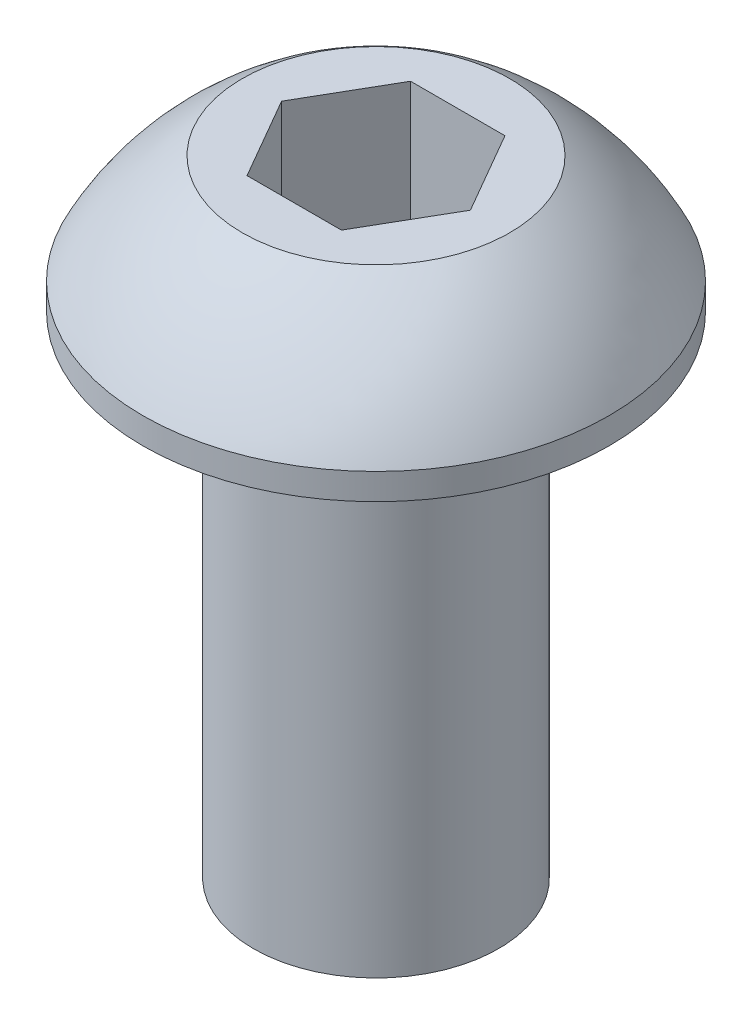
from build123d import *

# Parameters (mm, degrees)
CUT_EXTRUDE1_DEPTH = 1.524


with BuildPart() as part:
    # profiile → Base-Revolve (revolve)
    with BuildSketch(Plane.XY, mode=Mode.PRIVATE) as base_revolve_sk:
        with BuildLine():
            Line((0, 1.65), (1.634978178, 1.65))
            ThreePointArc((1.634978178, 1.65), (2.333092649, 1.06790397), (2.85, 0.320236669))
            Line((2.85, 0.320236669), (2.85, 0))
            Line((2.85, 0), (1.5, 0))
            Line((1.5, 0), (1.5, -6))
            Line((1.5, -6), (0, -6))
            Line((0, -6), (0, 1.65))
        make_face()
    revolve(base_revolve_sk.sketch.rotate(Axis((0, 9.907210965, 0), (0, -1, 0)), 90), axis=Axis((0, 9.907210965, 0), (0, -1, 0)))

    # Sketch1 → Cut-Extrude1 (cut)
    with BuildSketch(Plane(origin=(0, 1.65, 0), x_dir=(-1, 0, 0), z_dir=(0, 1, 0))):
        Polygon((1.154700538, 0), (0.577350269, 1), (-0.577350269, 1), (-1.154700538, 0), (-0.577350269, -1), (0.577350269, -1), align=None)
    extrude(amount=-CUT_EXTRUDE1_DEPTH, mode=Mode.SUBTRACT)


solid = part.part
